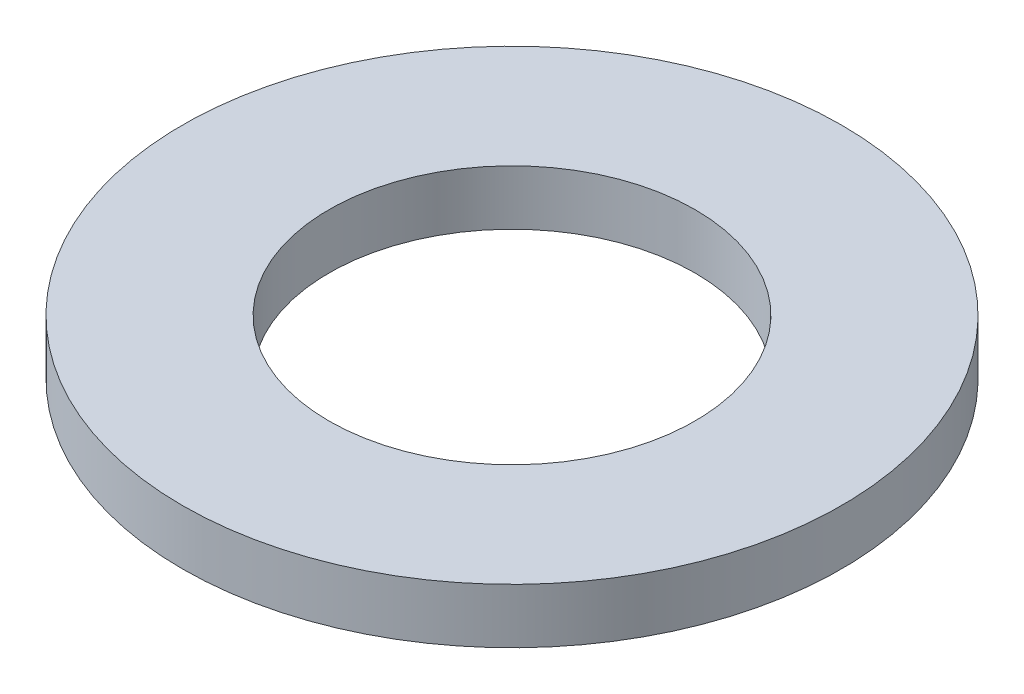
from build123d import *

# Parameters (mm, degrees)
SKETCH1_R      = 36
SKETCH1_R_2    = 20
EXTRUDE1_DEPTH = 6


with BuildPart() as part:
    # Sketch1 → Extrude1 (new body)
    with BuildSketch(Plane(origin=(0, 0, 0), x_dir=(1, 0, 0), z_dir=(0, 1, 0))):
        with Locations(Location((0, 0, 0), (0, 0, 270))):
            Circle(SKETCH1_R)
        with Locations(Location((0, 0, 0), (0, 0, 270))):
            Circle(SKETCH1_R_2, mode=Mode.SUBTRACT)
    extrude(amount=EXTRUDE1_DEPTH)


solid = part.part
